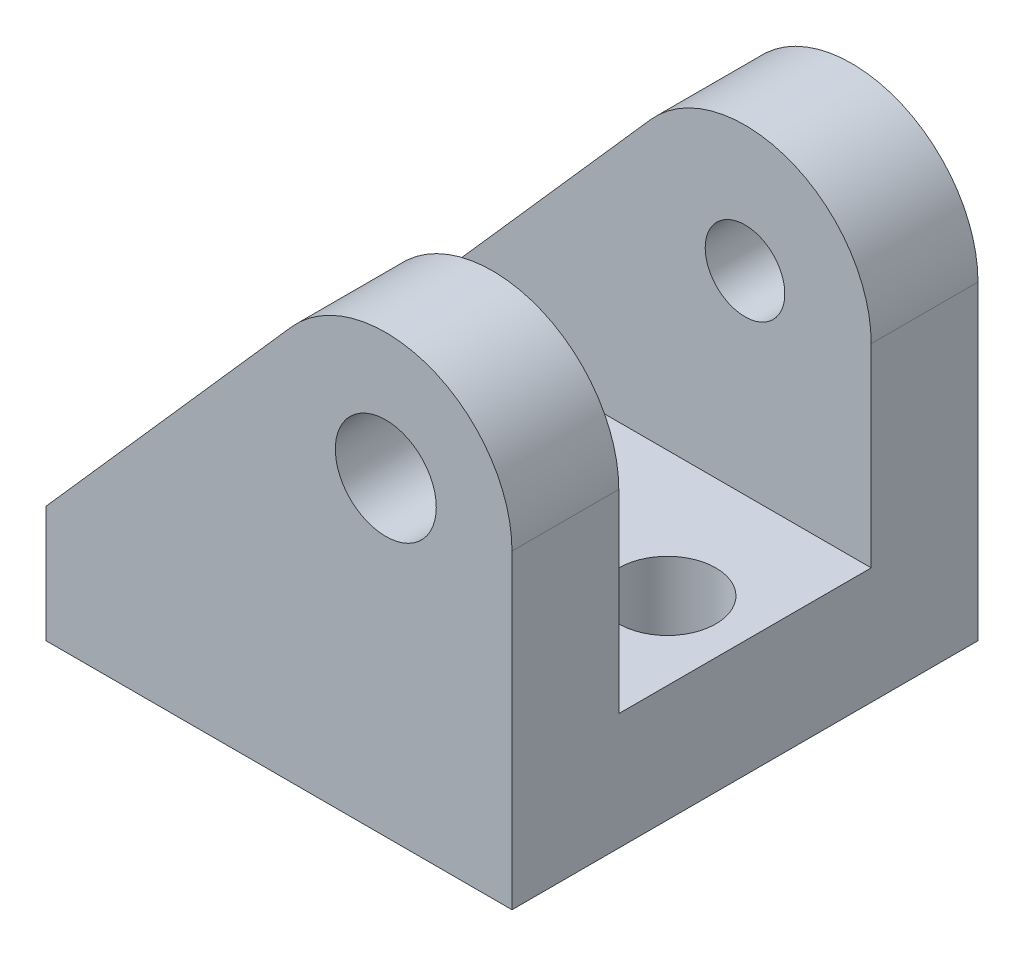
ISO-10303-21;
HEADER;
FILE_DESCRIPTION(('STEP AP214'),'2;1');
FILE_NAME('part.step','',(''),(''),'','','');
FILE_SCHEMA(('AUTOMOTIVE_DESIGN { 1 0 10303 214 1 1 1 1 }'));
ENDSEC;
DATA;
#1=APPLICATION_CONTEXT('core data for automotive mechanical design processes');
#2=APPLICATION_PROTOCOL_DEFINITION('international standard','automotive_design',2000,#1);
#3=PRODUCT_CONTEXT('',#1,'mechanical');
#4=PRODUCT('Part','Part','',(#3));
#5=PRODUCT_RELATED_PRODUCT_CATEGORY('part','',(#4));
#6=PRODUCT_DEFINITION_FORMATION('','',#4);
#7=PRODUCT_DEFINITION_CONTEXT('part definition',#1,'design');
#8=PRODUCT_DEFINITION('design','',#6,#7);
#9=PRODUCT_DEFINITION_SHAPE('','',#8);
#10=(LENGTH_UNIT() NAMED_UNIT(*) SI_UNIT(.MILLI.,.METRE.));
#11=(NAMED_UNIT(*) PLANE_ANGLE_UNIT() SI_UNIT($,.RADIAN.));
#12=(NAMED_UNIT(*) SI_UNIT($,.STERADIAN.) SOLID_ANGLE_UNIT());
#13=UNCERTAINTY_MEASURE_WITH_UNIT(LENGTH_MEASURE(1.E-05),#10,'distance_accuracy_value','');
#14=(GEOMETRIC_REPRESENTATION_CONTEXT(3) GLOBAL_UNCERTAINTY_ASSIGNED_CONTEXT((#13)) GLOBAL_UNIT_ASSIGNED_CONTEXT((#10,
#11,#12)) REPRESENTATION_CONTEXT('',''));
#15=CARTESIAN_POINT('',(0.,0.,0.));
#16=DIRECTION('',(0.,0.,1.));
#17=DIRECTION('',(1.,0.,0.));
#18=AXIS2_PLACEMENT_3D('',#15,#16,#17);
#19=CARTESIAN_POINT('',(0.,8.,6.));
#20=DIRECTION('',(0.,0.,-1.));
#21=DIRECTION('',(-1.,0.,0.));
#22=AXIS2_PLACEMENT_3D('',#19,#20,#21);
#23=CYLINDRICAL_SURFACE('',#22,3.25);
#24=DIRECTION('',(0.,0.,-1.));
#25=VECTOR('',#24,1.);
#26=CARTESIAN_POINT('',(-2.4363027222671,10.1510297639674,6.));
#27=LINE('',#26,#25);
#28=CARTESIAN_POINT('',(-2.4363027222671,10.1510297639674,-3.25));
#29=VERTEX_POINT('',#28);
#30=CARTESIAN_POINT('',(-2.4363027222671,10.1510297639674,-6.));
#31=VERTEX_POINT('',#30);
#32=EDGE_CURVE('E145',#29,#31,#27,.T.);
#33=ORIENTED_EDGE('',*,*,#32,.F.);
#34=CARTESIAN_POINT('',(0.,8.,-3.25));
#35=DIRECTION('',(0.,0.,-1.));
#36=DIRECTION('',(-1.,0.,0.));
#37=AXIS2_PLACEMENT_3D('',#34,#35,#36);
#38=CIRCLE('',#37,3.25);
#39=CARTESIAN_POINT('',(3.25000000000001,8.,-3.25));
#40=VERTEX_POINT('',#39);
#41=EDGE_CURVE('E178',#29,#40,#38,.T.);
#42=ORIENTED_EDGE('',*,*,#41,.T.);
#43=DIRECTION('',(0.,0.,-1.));
#44=VECTOR('',#43,1.);
#45=CARTESIAN_POINT('',(3.25000000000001,8.,6.));
#46=LINE('',#45,#44);
#47=CARTESIAN_POINT('',(3.25000000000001,8.,-6.));
#48=VERTEX_POINT('',#47);
#49=EDGE_CURVE('E87',#40,#48,#46,.T.);
#50=ORIENTED_EDGE('',*,*,#49,.T.);
#51=CARTESIAN_POINT('',(0.,8.,-6.));
#52=DIRECTION('',(0.,0.,1.));
#53=DIRECTION('',(1.,0.,0.));
#54=AXIS2_PLACEMENT_3D('',#51,#52,#53);
#55=CIRCLE('',#54,3.25);
#56=EDGE_CURVE('E127',#48,#31,#55,.T.);
#57=ORIENTED_EDGE('',*,*,#56,.T.);
#58=EDGE_LOOP('',(#33,#42,#50,#57));
#59=FACE_BOUND('',#58,.T.);
#60=ADVANCED_FACE('F36',(#59),#23,.T.);
#61=CARTESIAN_POINT('',(-2.4363027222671,10.1510297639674,6.));
#62=DIRECTION('',(0.749631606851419,-0.661855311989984,0.));
#63=DIRECTION('',(0.661855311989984,0.749631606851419,0.));
#64=AXIS2_PLACEMENT_3D('',#61,#62,#63);
#65=PLANE('',#64);
#66=DIRECTION('',(0.,0.,-1.));
#67=VECTOR('',#66,1.);
#68=CARTESIAN_POINT('',(-8.74999999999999,3.,6.));
#69=LINE('',#68,#67);
#70=CARTESIAN_POINT('',(-8.74999999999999,2.99999999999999,-3.25));
#71=VERTEX_POINT('',#70);
#72=CARTESIAN_POINT('',(-8.74999999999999,3.,-6.));
#73=VERTEX_POINT('',#72);
#74=EDGE_CURVE('E118',#71,#73,#69,.T.);
#75=ORIENTED_EDGE('',*,*,#74,.F.);
#76=DIRECTION('',(0.661855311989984,0.749631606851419,0.));
#77=VECTOR('',#76,1.);
#78=CARTESIAN_POINT('',(-2.4363027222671,10.1510297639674,-3.25));
#79=LINE('',#78,#77);
#80=EDGE_CURVE('E130',#71,#29,#79,.T.);
#81=ORIENTED_EDGE('',*,*,#80,.T.);
#82=ORIENTED_EDGE('',*,*,#32,.T.);
#83=DIRECTION('',(-0.661855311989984,-0.749631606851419,0.));
#84=VECTOR('',#83,1.);
#85=CARTESIAN_POINT('',(-2.4363027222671,10.1510297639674,-6.));
#86=LINE('',#85,#84);
#87=EDGE_CURVE('E129',#31,#73,#86,.T.);
#88=ORIENTED_EDGE('',*,*,#87,.T.);
#89=EDGE_LOOP('',(#75,#81,#82,#88));
#90=FACE_BOUND('',#89,.T.);
#91=ADVANCED_FACE('F215',(#90),#65,.F.);
#92=CARTESIAN_POINT('',(3.25000000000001,8.,6.));
#93=VERTEX_POINT('',#92);
#94=CARTESIAN_POINT('',(3.25000000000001,8.,3.25));
#95=VERTEX_POINT('',#94);
#96=EDGE_CURVE('E139',#93,#95,#46,.T.);
#97=ORIENTED_EDGE('',*,*,#96,.T.);
#98=CARTESIAN_POINT('',(0.,8.,3.25));
#99=DIRECTION('',(0.,0.,1.));
#100=DIRECTION('',(1.,0.,0.));
#101=AXIS2_PLACEMENT_3D('',#98,#99,#100);
#102=CIRCLE('',#101,3.25);
#103=CARTESIAN_POINT('',(-2.4363027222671,10.1510297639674,3.25));
#104=VERTEX_POINT('',#103);
#105=EDGE_CURVE('E172',#95,#104,#102,.T.);
#106=ORIENTED_EDGE('',*,*,#105,.T.);
#107=CARTESIAN_POINT('',(-2.4363027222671,10.1510297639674,6.));
#108=VERTEX_POINT('',#107);
#109=EDGE_CURVE('E146',#108,#104,#27,.T.);
#110=ORIENTED_EDGE('',*,*,#109,.F.);
#111=CARTESIAN_POINT('',(0.,8.,6.));
#112=DIRECTION('',(0.,0.,1.));
#113=DIRECTION('',(1.,0.,0.));
#114=AXIS2_PLACEMENT_3D('',#111,#112,#113);
#115=CIRCLE('',#114,3.25);
#116=EDGE_CURVE('E138',#93,#108,#115,.T.);
#117=ORIENTED_EDGE('',*,*,#116,.F.);
#118=EDGE_LOOP('',(#97,#106,#110,#117));
#119=FACE_BOUND('',#118,.T.);
#120=ADVANCED_FACE('F38',(#119),#23,.T.);
#121=ORIENTED_EDGE('',*,*,#109,.T.);
#122=DIRECTION('',(-0.661855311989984,-0.749631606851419,0.));
#123=VECTOR('',#122,1.);
#124=CARTESIAN_POINT('',(-2.4363027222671,10.1510297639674,3.25));
#125=LINE('',#124,#123);
#126=CARTESIAN_POINT('',(-8.74999999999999,2.99999999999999,3.25));
#127=VERTEX_POINT('',#126);
#128=EDGE_CURVE('E175',#104,#127,#125,.T.);
#129=ORIENTED_EDGE('',*,*,#128,.T.);
#130=CARTESIAN_POINT('',(-8.74999999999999,3.,6.));
#131=VERTEX_POINT('',#130);
#132=EDGE_CURVE('E143',#131,#127,#69,.T.);
#133=ORIENTED_EDGE('',*,*,#132,.F.);
#134=DIRECTION('',(-0.661855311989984,-0.749631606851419,0.));
#135=VECTOR('',#134,1.);
#136=CARTESIAN_POINT('',(-2.4363027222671,10.1510297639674,6.));
#137=LINE('',#136,#135);
#138=EDGE_CURVE('E96',#108,#131,#137,.T.);
#139=ORIENTED_EDGE('',*,*,#138,.F.);
#140=EDGE_LOOP('',(#121,#129,#133,#139));
#141=FACE_BOUND('',#140,.T.);
#142=ADVANCED_FACE('F187',(#141),#65,.F.);
#143=CARTESIAN_POINT('',(-8.74999999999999,3.,6.));
#144=DIRECTION('',(1.,0.,0.));
#145=DIRECTION('',(0.,0.,-1.));
#146=AXIS2_PLACEMENT_3D('',#143,#144,#145);
#147=PLANE('',#146);
#148=DIRECTION('',(0.,-1.,0.));
#149=VECTOR('',#148,1.);
#150=CARTESIAN_POINT('',(-8.74999999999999,3.,-6.));
#151=LINE('',#150,#149);
#152=CARTESIAN_POINT('',(-8.74999999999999,0.,-6.));
#153=VERTEX_POINT('',#152);
#154=EDGE_CURVE('E115',#73,#153,#151,.T.);
#155=ORIENTED_EDGE('',*,*,#154,.T.);
#156=DIRECTION('',(0.,0.,-1.));
#157=VECTOR('',#156,1.);
#158=CARTESIAN_POINT('',(-8.74999999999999,0.,6.));
#159=LINE('',#158,#157);
#160=CARTESIAN_POINT('',(-8.74999999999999,0.,6.));
#161=VERTEX_POINT('',#160);
#162=EDGE_CURVE('E112',#161,#153,#159,.T.);
#163=ORIENTED_EDGE('',*,*,#162,.F.);
#164=DIRECTION('',(0.,-1.,0.));
#165=VECTOR('',#164,1.);
#166=CARTESIAN_POINT('',(-8.74999999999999,3.,6.));
#167=LINE('',#166,#165);
#168=EDGE_CURVE('E102',#131,#161,#167,.T.);
#169=ORIENTED_EDGE('',*,*,#168,.F.);
#170=ORIENTED_EDGE('',*,*,#132,.T.);
#171=DIRECTION('',(0.,0.,1.));
#172=VECTOR('',#171,1.);
#173=CARTESIAN_POINT('',(-8.74999999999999,2.99999999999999,6.));
#174=LINE('',#173,#172);
#175=EDGE_CURVE('E170',#71,#127,#174,.T.);
#176=ORIENTED_EDGE('',*,*,#175,.F.);
#177=ORIENTED_EDGE('',*,*,#74,.T.);
#178=EDGE_LOOP('',(#155,#163,#169,#170,#176,#177));
#179=FACE_BOUND('',#178,.T.);
#180=ADVANCED_FACE('F113',(#179),#147,.F.);
#181=CARTESIAN_POINT('',(-8.74999999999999,0.,6.));
#182=DIRECTION('',(0.,1.,0.));
#183=DIRECTION('',(0.,0.,1.));
#184=AXIS2_PLACEMENT_3D('',#181,#182,#183);
#185=PLANE('',#184);
#186=CARTESIAN_POINT('',(-6.74999999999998,0.,0.));
#187=DIRECTION('',(0.,-1.,0.));
#188=DIRECTION('',(0.,0.,-1.));
#189=AXIS2_PLACEMENT_3D('',#186,#187,#188);
#190=CIRCLE('',#189,1.25);
#191=CARTESIAN_POINT('',(-6.74999999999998,0.,-1.25));
#192=VERTEX_POINT('',#191);
#193=EDGE_CURVE('E347',#192,#192,#190,.T.);
#194=ORIENTED_EDGE('',*,*,#193,.F.);
#195=EDGE_LOOP('',(#194));
#196=FACE_BOUND('',#195,.T.);
#197=CARTESIAN_POINT('',(1.25000000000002,0.,0.));
#198=DIRECTION('',(0.,-1.,0.));
#199=DIRECTION('',(0.,0.,-1.));
#200=AXIS2_PLACEMENT_3D('',#197,#198,#199);
#201=CIRCLE('',#200,1.25);
#202=CARTESIAN_POINT('',(1.25000000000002,0.,-1.25));
#203=VERTEX_POINT('',#202);
#204=EDGE_CURVE('E349',#203,#203,#201,.T.);
#205=ORIENTED_EDGE('',*,*,#204,.F.);
#206=EDGE_LOOP('',(#205));
#207=FACE_BOUND('',#206,.T.);
#208=DIRECTION('',(1.,0.,0.));
#209=VECTOR('',#208,1.);
#210=CARTESIAN_POINT('',(-8.74999999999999,0.,-6.));
#211=LINE('',#210,#209);
#212=CARTESIAN_POINT('',(3.25000000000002,0.,-6.));
#213=VERTEX_POINT('',#212);
#214=EDGE_CURVE('E134',#153,#213,#211,.T.);
#215=ORIENTED_EDGE('',*,*,#214,.T.);
#216=DIRECTION('',(0.,0.,-1.));
#217=VECTOR('',#216,1.);
#218=CARTESIAN_POINT('',(3.25000000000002,0.,6.));
#219=LINE('',#218,#217);
#220=CARTESIAN_POINT('',(3.25000000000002,0.,6.));
#221=VERTEX_POINT('',#220);
#222=EDGE_CURVE('E119',#221,#213,#219,.T.);
#223=ORIENTED_EDGE('',*,*,#222,.F.);
#224=DIRECTION('',(1.,0.,0.));
#225=VECTOR('',#224,1.);
#226=CARTESIAN_POINT('',(-8.74999999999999,0.,6.));
#227=LINE('',#226,#225);
#228=EDGE_CURVE('E106',#161,#221,#227,.T.);
#229=ORIENTED_EDGE('',*,*,#228,.F.);
#230=ORIENTED_EDGE('',*,*,#162,.T.);
#231=EDGE_LOOP('',(#215,#223,#229,#230));
#232=FACE_BOUND('',#231,.T.);
#233=ADVANCED_FACE('F121',(#196,#207,#232),#185,.F.);
#234=CARTESIAN_POINT('',(3.25000000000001,8.,6.));
#235=DIRECTION('',(-1.,0.,0.));
#236=DIRECTION('',(0.,-1.,0.));
#237=AXIS2_PLACEMENT_3D('',#234,#235,#236);
#238=PLANE('',#237);
#239=ORIENTED_EDGE('',*,*,#49,.F.);
#240=DIRECTION('',(0.,-1.,0.));
#241=VECTOR('',#240,1.);
#242=CARTESIAN_POINT('',(3.25000000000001,8.,-3.25));
#243=LINE('',#242,#241);
#244=CARTESIAN_POINT('',(3.25000000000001,3.,-3.25));
#245=VERTEX_POINT('',#244);
#246=EDGE_CURVE('E11',#40,#245,#243,.T.);
#247=ORIENTED_EDGE('',*,*,#246,.T.);
#248=DIRECTION('',(0.,0.,-1.));
#249=VECTOR('',#248,1.);
#250=CARTESIAN_POINT('',(3.25000000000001,3.,6.));
#251=LINE('',#250,#249);
#252=CARTESIAN_POINT('',(3.25000000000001,3.,3.25));
#253=VERTEX_POINT('',#252);
#254=EDGE_CURVE('E148',#253,#245,#251,.T.);
#255=ORIENTED_EDGE('',*,*,#254,.F.);
#256=DIRECTION('',(0.,1.,0.));
#257=VECTOR('',#256,1.);
#258=CARTESIAN_POINT('',(3.25000000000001,8.,3.25));
#259=LINE('',#258,#257);
#260=EDGE_CURVE('E45',#253,#95,#259,.T.);
#261=ORIENTED_EDGE('',*,*,#260,.T.);
#262=ORIENTED_EDGE('',*,*,#96,.F.);
#263=DIRECTION('',(0.,1.,0.));
#264=VECTOR('',#263,1.);
#265=CARTESIAN_POINT('',(3.25000000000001,8.,6.));
#266=LINE('',#265,#264);
#267=EDGE_CURVE('E62',#221,#93,#266,.T.);
#268=ORIENTED_EDGE('',*,*,#267,.F.);
#269=ORIENTED_EDGE('',*,*,#222,.T.);
#270=DIRECTION('',(0.,1.,0.));
#271=VECTOR('',#270,1.);
#272=CARTESIAN_POINT('',(3.25000000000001,8.,-6.));
#273=LINE('',#272,#271);
#274=EDGE_CURVE('E136',#213,#48,#273,.T.);
#275=ORIENTED_EDGE('',*,*,#274,.T.);
#276=EDGE_LOOP('',(#239,#247,#255,#261,#262,#268,#269,#275));
#277=FACE_BOUND('',#276,.T.);
#278=ADVANCED_FACE('F209',(#277),#238,.F.);
#279=CARTESIAN_POINT('',(0.,8.,6.));
#280=DIRECTION('',(0.,0.,1.));
#281=DIRECTION('',(1.,0.,0.));
#282=AXIS2_PLACEMENT_3D('',#279,#280,#281);
#283=PLANE('',#282);
#284=CARTESIAN_POINT('',(0.,8.,6.));
#285=DIRECTION('',(0.,0.,1.));
#286=DIRECTION('',(1.,0.,0.));
#287=AXIS2_PLACEMENT_3D('',#284,#285,#286);
#288=CIRCLE('',#287,1.3);
#289=CARTESIAN_POINT('',(1.30000000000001,8.,6.));
#290=VERTEX_POINT('',#289);
#291=EDGE_CURVE('E153',#290,#290,#288,.T.);
#292=ORIENTED_EDGE('',*,*,#291,.F.);
#293=EDGE_LOOP('',(#292));
#294=FACE_BOUND('',#293,.T.);
#295=ORIENTED_EDGE('',*,*,#116,.T.);
#296=ORIENTED_EDGE('',*,*,#138,.T.);
#297=ORIENTED_EDGE('',*,*,#168,.T.);
#298=ORIENTED_EDGE('',*,*,#228,.T.);
#299=ORIENTED_EDGE('',*,*,#267,.T.);
#300=EDGE_LOOP('',(#295,#296,#297,#298,#299));
#301=FACE_BOUND('',#300,.T.);
#302=ADVANCED_FACE('F104',(#294,#301),#283,.T.);
#303=CARTESIAN_POINT('',(0.,8.,-6.));
#304=DIRECTION('',(0.,0.,1.));
#305=DIRECTION('',(1.,0.,0.));
#306=AXIS2_PLACEMENT_3D('',#303,#304,#305);
#307=PLANE('',#306);
#308=CARTESIAN_POINT('',(0.,8.,-6.));
#309=DIRECTION('',(0.,0.,-1.));
#310=DIRECTION('',(-1.,0.,0.));
#311=AXIS2_PLACEMENT_3D('',#308,#309,#310);
#312=CIRCLE('',#311,1.025);
#313=CARTESIAN_POINT('',(-1.02499999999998,8.,-6.));
#314=VERTEX_POINT('',#313);
#315=EDGE_CURVE('E164',#314,#314,#312,.T.);
#316=ORIENTED_EDGE('',*,*,#315,.F.);
#317=EDGE_LOOP('',(#316));
#318=FACE_BOUND('',#317,.T.);
#319=ORIENTED_EDGE('',*,*,#56,.F.);
#320=ORIENTED_EDGE('',*,*,#274,.F.);
#321=ORIENTED_EDGE('',*,*,#214,.F.);
#322=ORIENTED_EDGE('',*,*,#154,.F.);
#323=ORIENTED_EDGE('',*,*,#87,.F.);
#324=EDGE_LOOP('',(#319,#320,#321,#322,#323));
#325=FACE_BOUND('',#324,.T.);
#326=ADVANCED_FACE('F220',(#318,#325),#307,.F.);
#327=CARTESIAN_POINT('',(-16.2843329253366,23.,-3.25));
#328=DIRECTION('',(0.,0.,-1.));
#329=DIRECTION('',(-1.,0.,0.));
#330=AXIS2_PLACEMENT_3D('',#327,#328,#329);
#331=PLANE('',#330);
#332=CARTESIAN_POINT('',(0.,8.,-3.25));
#333=DIRECTION('',(0.,0.,-1.));
#334=DIRECTION('',(-1.,0.,0.));
#335=AXIS2_PLACEMENT_3D('',#332,#333,#334);
#336=CIRCLE('',#335,1.025);
#337=CARTESIAN_POINT('',(-1.02499999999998,8.,-3.25));
#338=VERTEX_POINT('',#337);
#339=EDGE_CURVE('E159',#338,#338,#336,.T.);
#340=ORIENTED_EDGE('',*,*,#339,.T.);
#341=EDGE_LOOP('',(#340));
#342=FACE_BOUND('',#341,.T.);
#343=DIRECTION('',(1.,0.,0.));
#344=VECTOR('',#343,1.);
#345=CARTESIAN_POINT('',(-16.2843329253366,2.99999999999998,-3.25));
#346=LINE('',#345,#344);
#347=EDGE_CURVE('E156',#71,#245,#346,.T.);
#348=ORIENTED_EDGE('',*,*,#347,.T.);
#349=ORIENTED_EDGE('',*,*,#246,.F.);
#350=ORIENTED_EDGE('',*,*,#41,.F.);
#351=ORIENTED_EDGE('',*,*,#80,.F.);
#352=EDGE_LOOP('',(#348,#349,#350,#351));
#353=FACE_BOUND('',#352,.T.);
#354=ADVANCED_FACE('F211',(#342,#353),#331,.F.);
#355=CARTESIAN_POINT('',(-16.2843329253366,23.,3.25));
#356=DIRECTION('',(0.,0.,1.));
#357=DIRECTION('',(1.,0.,0.));
#358=AXIS2_PLACEMENT_3D('',#355,#356,#357);
#359=PLANE('',#358);
#360=CARTESIAN_POINT('',(0.,8.,3.25));
#361=DIRECTION('',(0.,0.,1.));
#362=DIRECTION('',(1.,0.,0.));
#363=AXIS2_PLACEMENT_3D('',#360,#361,#362);
#364=CIRCLE('',#363,1.3);
#365=CARTESIAN_POINT('',(1.30000000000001,8.,3.25));
#366=VERTEX_POINT('',#365);
#367=EDGE_CURVE('E151',#366,#366,#364,.T.);
#368=ORIENTED_EDGE('',*,*,#367,.T.);
#369=EDGE_LOOP('',(#368));
#370=FACE_BOUND('',#369,.T.);
#371=ORIENTED_EDGE('',*,*,#105,.F.);
#372=ORIENTED_EDGE('',*,*,#260,.F.);
#373=DIRECTION('',(-1.,0.,0.));
#374=VECTOR('',#373,1.);
#375=CARTESIAN_POINT('',(-16.2843329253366,2.99999999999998,3.25));
#376=LINE('',#375,#374);
#377=EDGE_CURVE('E53',#253,#127,#376,.T.);
#378=ORIENTED_EDGE('',*,*,#377,.T.);
#379=ORIENTED_EDGE('',*,*,#128,.F.);
#380=EDGE_LOOP('',(#371,#372,#378,#379));
#381=FACE_BOUND('',#380,.T.);
#382=ADVANCED_FACE('F206',(#370,#381),#359,.F.);
#383=CARTESIAN_POINT('',(0.,3.,0.));
#384=DIRECTION('',(0.,1.,0.));
#385=DIRECTION('',(-1.,0.,0.));
#386=AXIS2_PLACEMENT_3D('',#383,#384,#385);
#387=PLANE('',#386);
#388=CARTESIAN_POINT('',(-6.74999999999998,2.99999999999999,0.));
#389=DIRECTION('',(0.,1.,0.));
#390=DIRECTION('',(-1.,0.,0.));
#391=AXIS2_PLACEMENT_3D('',#388,#389,#390);
#392=CIRCLE('',#391,1.25);
#393=CARTESIAN_POINT('',(-7.99999999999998,2.99999999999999,0.));
#394=VERTEX_POINT('',#393);
#395=EDGE_CURVE('E40',#394,#394,#392,.T.);
#396=ORIENTED_EDGE('',*,*,#395,.F.);
#397=EDGE_LOOP('',(#396));
#398=FACE_BOUND('',#397,.T.);
#399=CARTESIAN_POINT('',(1.25000000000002,3.,0.));
#400=DIRECTION('',(0.,1.,0.));
#401=DIRECTION('',(-1.,0.,0.));
#402=AXIS2_PLACEMENT_3D('',#399,#400,#401);
#403=CIRCLE('',#402,1.25);
#404=CARTESIAN_POINT('',(0.,3.,0.));
#405=VERTEX_POINT('',#404);
#406=EDGE_CURVE('E353',#405,#405,#403,.T.);
#407=ORIENTED_EDGE('',*,*,#406,.F.);
#408=EDGE_LOOP('',(#407));
#409=FACE_BOUND('',#408,.T.);
#410=ORIENTED_EDGE('',*,*,#175,.T.);
#411=ORIENTED_EDGE('',*,*,#377,.F.);
#412=ORIENTED_EDGE('',*,*,#254,.T.);
#413=ORIENTED_EDGE('',*,*,#347,.F.);
#414=EDGE_LOOP('',(#410,#411,#412,#413));
#415=FACE_BOUND('',#414,.T.);
#416=ADVANCED_FACE('F204',(#398,#409,#415),#387,.T.);
#417=CARTESIAN_POINT('',(0.,8.,1.));
#418=DIRECTION('',(0.,0.,1.));
#419=DIRECTION('',(1.,0.,0.));
#420=AXIS2_PLACEMENT_3D('',#417,#418,#419);
#421=CYLINDRICAL_SURFACE('',#420,1.3);
#422=ORIENTED_EDGE('',*,*,#291,.T.);
#423=EDGE_LOOP('',(#422));
#424=FACE_BOUND('',#423,.T.);
#425=ORIENTED_EDGE('',*,*,#367,.F.);
#426=EDGE_LOOP('',(#425));
#427=FACE_BOUND('',#426,.T.);
#428=ADVANCED_FACE('F276',(#424,#427),#421,.F.);
#429=CARTESIAN_POINT('',(0.,8.,-6.));
#430=DIRECTION('',(0.,0.,-1.));
#431=DIRECTION('',(-1.,0.,0.));
#432=AXIS2_PLACEMENT_3D('',#429,#430,#431);
#433=CYLINDRICAL_SURFACE('',#432,1.025);
#434=ORIENTED_EDGE('',*,*,#315,.T.);
#435=EDGE_LOOP('',(#434));
#436=FACE_BOUND('',#435,.T.);
#437=ORIENTED_EDGE('',*,*,#339,.F.);
#438=EDGE_LOOP('',(#437));
#439=FACE_BOUND('',#438,.T.);
#440=ADVANCED_FACE('F280',(#436,#439),#433,.F.);
#441=CARTESIAN_POINT('',(1.25000000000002,0.,0.));
#442=DIRECTION('',(0.,-1.,0.));
#443=DIRECTION('',(0.,0.,-1.));
#444=AXIS2_PLACEMENT_3D('',#441,#442,#443);
#445=CYLINDRICAL_SURFACE('',#444,1.25);
#446=ORIENTED_EDGE('',*,*,#406,.T.);
#447=EDGE_LOOP('',(#446));
#448=FACE_BOUND('',#447,.T.);
#449=ORIENTED_EDGE('',*,*,#204,.T.);
#450=EDGE_LOOP('',(#449));
#451=FACE_BOUND('',#450,.T.);
#452=ADVANCED_FACE('F300',(#448,#451),#445,.F.);
#453=CARTESIAN_POINT('',(-6.74999999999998,0.,0.));
#454=DIRECTION('',(0.,-1.,0.));
#455=DIRECTION('',(0.,0.,-1.));
#456=AXIS2_PLACEMENT_3D('',#453,#454,#455);
#457=CYLINDRICAL_SURFACE('',#456,1.25);
#458=ORIENTED_EDGE('',*,*,#395,.T.);
#459=EDGE_LOOP('',(#458));
#460=FACE_BOUND('',#459,.T.);
#461=ORIENTED_EDGE('',*,*,#193,.T.);
#462=EDGE_LOOP('',(#461));
#463=FACE_BOUND('',#462,.T.);
#464=ADVANCED_FACE('F325',(#460,#463),#457,.F.);
#465=CLOSED_SHELL('',(#60,#91,#120,#142,#180,#233,#278,#302,#326,#354,#382,#416,#428,#440,#452,#464));
#466=MANIFOLD_SOLID_BREP('B2',#465);
#467=ADVANCED_BREP_SHAPE_REPRESENTATION('',(#18,#466),#14);
#468=SHAPE_DEFINITION_REPRESENTATION(#9,#467);
ENDSEC;
END-ISO-10303-21;
